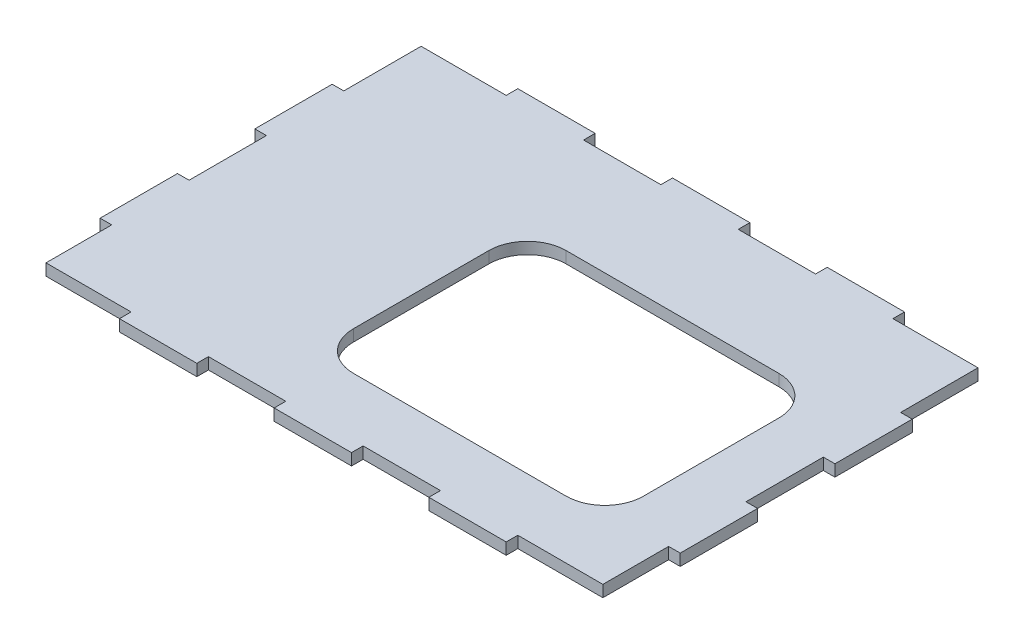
from build123d import *

# Parameters (mm, degrees)
SKETCH1_W           = 600
SKETCH1_H           = 800
BOSS_EXTRUDE1_DEPTH = 12
SKETCH2_W           = 12
SKETCH2_H           = 136
SKETCH2_W_2         = 80
SKETCH2_H_2         = 12
SKETCH2_H_3         = 80
CUT_EXTRUDE1_DEPTH  = 12
SKETCH3_W           = 650
SKETCH3_H           = 400
CUT_EXTRUDE2_DEPTH  = 1001.071997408
CUT_EXTRUDE3_DEPTH  = 1001.071997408
SKETCH5_W           = 80
SKETCH5_H           = 12
BOSS_EXTRUDE3_DEPTH = 12


with BuildPart() as part:
    # Sketch1 → Boss-Extrude1 (new body)
    with BuildSketch(Plane(origin=(0, 0, 0), x_dir=(1, 0, 0), z_dir=(0, 1, 0))):
        with Locations((300, 400)):
            Rectangle(SKETCH1_W, SKETCH1_H)
    extrude(amount=BOSS_EXTRUDE1_DEPTH)

    # Sketch2 → Cut-Extrude1 (cut)
    with BuildSketch(Plane(origin=(0, 12, 0), x_dir=(1, 0, 0), z_dir=(0, 1, 0))):
        with Locations((594, 400)):
            Rectangle(SKETCH2_W, SKETCH2_H)
        Polygon((0, 0), (100, 0), (100, 12), (12, 12), (12, 92), (0, 92), (0, 12), align=None)
        with Locations((220, 6)):
            Rectangle(SKETCH2_W_2, SKETCH2_H_2)
        Polygon((600, 800), (600, 788), (600, 708), (588, 708), (588, 788), (500, 788), (500, 800), align=None)
        with Locations((380, 6)):
            Rectangle(SKETCH2_W_2, SKETCH2_H_2)
        Polygon((500, 0), (600, 0), (600, 12), (600, 92), (588, 92), (588, 12), (500, 12), align=None)
        with Locations((380, 794)):
            Rectangle(SKETCH2_W_2, SKETCH2_H_2)
        with Locations((220, 794)):
            Rectangle(SKETCH2_W_2, SKETCH2_H_2)
        Polygon((100, 800), (100, 788), (12, 788), (12, 708), (0, 708), (0, 788), (0, 800), align=None)
        with Locations((6, 212)):
            Rectangle(SKETCH2_W, SKETCH2_H_3)
        with Locations((6, 400)):
            Rectangle(SKETCH2_W, SKETCH2_H)
        with Locations((594, 212)):
            Rectangle(SKETCH2_W, SKETCH2_H_3)
        with Locations((594, 588)):
            Rectangle(SKETCH2_W, SKETCH2_H_3)
        with Locations((6, 588)):
            Rectangle(SKETCH2_W, SKETCH2_H_3)
    extrude(amount=-CUT_EXTRUDE1_DEPTH, mode=Mode.SUBTRACT)

    # Sketch3 → Cut-Extrude2 (cut, through all)
    with BuildSketch(Plane(origin=(0, 12, 0), x_dir=(1, 0, 0), z_dir=(0, 1, 0))):
        with Locations((325, 200)):
            Rectangle(SKETCH3_W, SKETCH3_H)
    extrude(amount=-CUT_EXTRUDE2_DEPTH, mode=Mode.SUBTRACT)

    # Sketch4 → Cut-Extrude3 (cut, through all)
    with BuildSketch(Plane(origin=(0, 12, 0), x_dir=(1, 0, 0), z_dir=(0, 1, 0))):
        with BuildLine():
            Line((270, 680), (490, 680))
            ThreePointArc((490, 680), (518.284271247, 668.284271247), (530, 640))
            Line((530, 640), (530, 500))
            ThreePointArc((530, 500), (518.284271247, 471.715728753), (490, 460))
            Line((490, 460), (270, 460))
            ThreePointArc((270, 460), (241.715728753, 471.715728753), (230, 500))
            Line((230, 500), (230, 640))
            ThreePointArc((230, 640), (241.715728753, 668.284271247), (270, 680))
        make_face()
    extrude(amount=-CUT_EXTRUDE3_DEPTH, mode=Mode.SUBTRACT)

    # Sketch5 → Boss-Extrude3 (add)
    with BuildSketch(Plane(origin=(0, 12, 0), x_dir=(1, 0, 0), z_dir=(0, 1, 0))):
        with Locations((140, 394)):
            Rectangle(SKETCH5_W, SKETCH5_H)
        with Locations((300, 394)):
            Rectangle(SKETCH5_W, SKETCH5_H)
        with Locations((460, 394)):
            Rectangle(SKETCH5_W, SKETCH5_H)
    extrude(amount=-BOSS_EXTRUDE3_DEPTH)


solid = part.part
